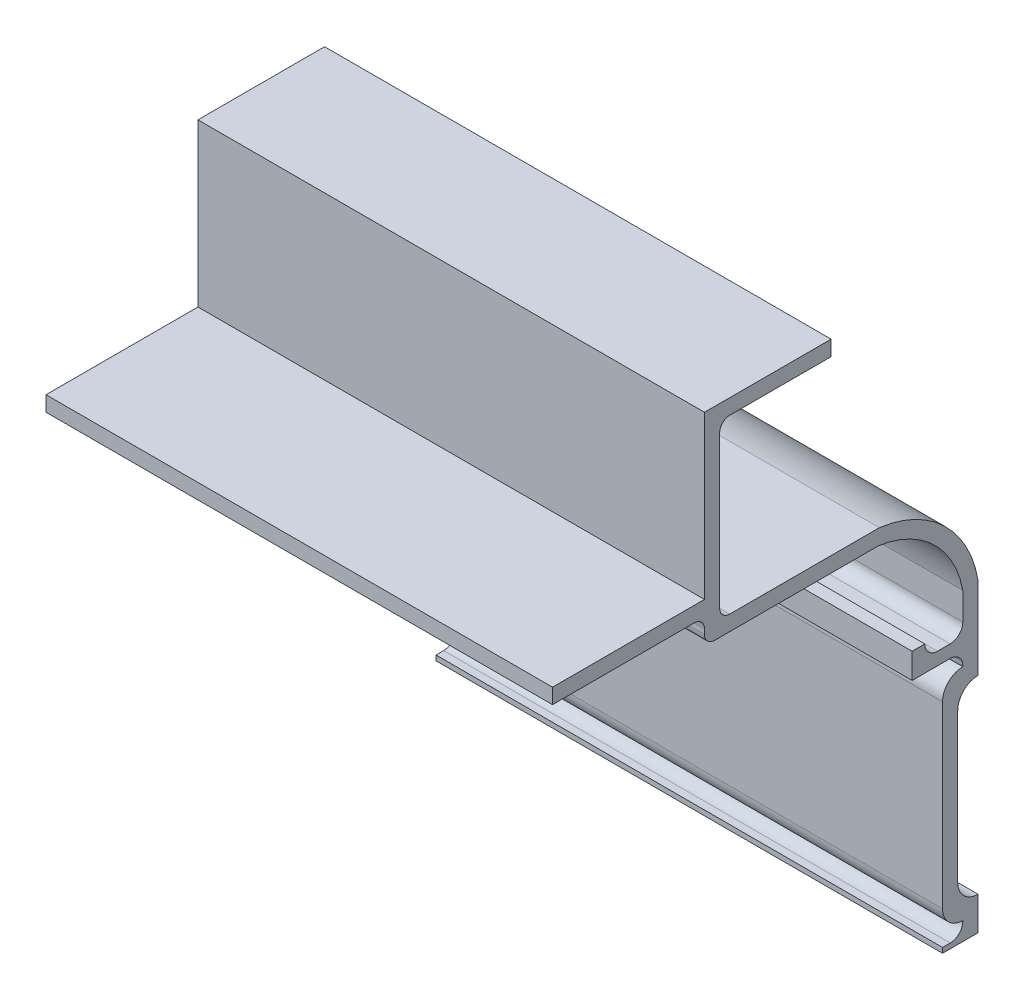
ISO-10303-21;
HEADER;
FILE_DESCRIPTION(('STEP AP214'),'2;1');
FILE_NAME('part.step','',(''),(''),'','','');
FILE_SCHEMA(('AUTOMOTIVE_DESIGN { 1 0 10303 214 1 1 1 1 }'));
ENDSEC;
DATA;
#1=APPLICATION_CONTEXT('core data for automotive mechanical design processes');
#2=APPLICATION_PROTOCOL_DEFINITION('international standard','automotive_design',2000,#1);
#3=PRODUCT_CONTEXT('',#1,'mechanical');
#4=PRODUCT('Part','Part','',(#3));
#5=PRODUCT_RELATED_PRODUCT_CATEGORY('part','',(#4));
#6=PRODUCT_DEFINITION_FORMATION('','',#4);
#7=PRODUCT_DEFINITION_CONTEXT('part definition',#1,'design');
#8=PRODUCT_DEFINITION('design','',#6,#7);
#9=PRODUCT_DEFINITION_SHAPE('','',#8);
#10=(LENGTH_UNIT() NAMED_UNIT(*) SI_UNIT(.MILLI.,.METRE.));
#11=(NAMED_UNIT(*) PLANE_ANGLE_UNIT() SI_UNIT($,.RADIAN.));
#12=(NAMED_UNIT(*) SI_UNIT($,.STERADIAN.) SOLID_ANGLE_UNIT());
#13=UNCERTAINTY_MEASURE_WITH_UNIT(LENGTH_MEASURE(1.E-05),#10,'distance_accuracy_value','');
#14=(GEOMETRIC_REPRESENTATION_CONTEXT(3) GLOBAL_UNCERTAINTY_ASSIGNED_CONTEXT((#13)) GLOBAL_UNIT_ASSIGNED_CONTEXT((#10,
#11,#12)) REPRESENTATION_CONTEXT('',''));
#15=CARTESIAN_POINT('',(0.,0.,0.));
#16=DIRECTION('',(0.,0.,1.));
#17=DIRECTION('',(1.,0.,0.));
#18=AXIS2_PLACEMENT_3D('',#15,#16,#17);
#19=CARTESIAN_POINT('',(50.,159.302992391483,-181.544676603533));
#20=DIRECTION('',(-1.,0.,0.));
#21=DIRECTION('',(0.,0.,1.));
#22=AXIS2_PLACEMENT_3D('',#19,#20,#21);
#23=CYLINDRICAL_SURFACE('',#22,22.6375207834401);
#24=CARTESIAN_POINT('',(-50.,159.302992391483,-181.544676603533));
#25=DIRECTION('',(1.,0.,0.));
#26=DIRECTION('',(0.,0.,-1.));
#27=AXIS2_PLACEMENT_3D('',#24,#25,#26);
#28=CIRCLE('',#27,22.6375207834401);
#29=CARTESIAN_POINT('',(-50.,163.045870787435,-203.870630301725));
#30=VERTEX_POINT('',#29);
#31=CARTESIAN_POINT('',(-50.,181.760397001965,-184.394645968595));
#32=VERTEX_POINT('',#31);
#33=EDGE_CURVE('E309',#30,#32,#28,.T.);
#34=ORIENTED_EDGE('',*,*,#33,.T.);
#35=DIRECTION('',(-1.,0.,0.));
#36=VECTOR('',#35,1.);
#37=CARTESIAN_POINT('',(50.,181.760397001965,-184.394645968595));
#38=LINE('',#37,#36);
#39=CARTESIAN_POINT('',(50.,181.760397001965,-184.394645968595));
#40=VERTEX_POINT('',#39);
#41=EDGE_CURVE('E11',#40,#32,#38,.T.);
#42=ORIENTED_EDGE('',*,*,#41,.F.);
#43=CARTESIAN_POINT('',(50.,159.302992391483,-181.544676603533));
#44=DIRECTION('',(1.,0.,0.));
#45=DIRECTION('',(0.,0.,-1.));
#46=AXIS2_PLACEMENT_3D('',#43,#44,#45);
#47=CIRCLE('',#46,22.6375207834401);
#48=CARTESIAN_POINT('',(50.,163.045870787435,-203.870630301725));
#49=VERTEX_POINT('',#48);
#50=EDGE_CURVE('E385',#49,#40,#47,.T.);
#51=ORIENTED_EDGE('',*,*,#50,.F.);
#52=DIRECTION('',(-1.,0.,0.));
#53=VECTOR('',#52,1.);
#54=CARTESIAN_POINT('',(50.,163.045870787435,-203.870630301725));
#55=LINE('',#54,#53);
#56=EDGE_CURVE('E305',#49,#30,#55,.T.);
#57=ORIENTED_EDGE('',*,*,#56,.T.);
#58=EDGE_LOOP('',(#34,#42,#51,#57));
#59=FACE_BOUND('',#58,.T.);
#60=ADVANCED_FACE('F32',(#59),#23,.T.);
#61=CARTESIAN_POINT('',(50.,181.760397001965,-154.870630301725));
#62=DIRECTION('',(0.,-1.,0.));
#63=DIRECTION('',(0.,0.,-1.));
#64=AXIS2_PLACEMENT_3D('',#61,#62,#63);
#65=PLANE('',#64);
#66=DIRECTION('',(0.,0.,1.));
#67=VECTOR('',#66,1.);
#68=CARTESIAN_POINT('',(-50.,181.760397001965,-154.870630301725));
#69=LINE('',#68,#67);
#70=CARTESIAN_POINT('',(-50.,181.760397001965,-154.870630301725));
#71=VERTEX_POINT('',#70);
#72=EDGE_CURVE('E312',#32,#71,#69,.T.);
#73=ORIENTED_EDGE('',*,*,#72,.T.);
#74=DIRECTION('',(-1.,0.,0.));
#75=VECTOR('',#74,1.);
#76=CARTESIAN_POINT('',(50.,181.760397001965,-154.870630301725));
#77=LINE('',#76,#75);
#78=CARTESIAN_POINT('',(50.,181.760397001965,-154.870630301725));
#79=VERTEX_POINT('',#78);
#80=EDGE_CURVE('E40',#79,#71,#77,.T.);
#81=ORIENTED_EDGE('',*,*,#80,.F.);
#82=DIRECTION('',(0.,0.,1.));
#83=VECTOR('',#82,1.);
#84=CARTESIAN_POINT('',(50.,181.760397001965,-154.870630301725));
#85=LINE('',#84,#83);
#86=EDGE_CURVE('E179',#40,#79,#85,.T.);
#87=ORIENTED_EDGE('',*,*,#86,.F.);
#88=ORIENTED_EDGE('',*,*,#41,.T.);
#89=EDGE_LOOP('',(#73,#81,#87,#88));
#90=FACE_BOUND('',#89,.T.);
#91=ADVANCED_FACE('F583',(#90),#65,.F.);
#92=CARTESIAN_POINT('',(50.,183.760397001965,-154.870630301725));
#93=DIRECTION('',(-1.,0.,0.));
#94=DIRECTION('',(0.,0.,1.));
#95=AXIS2_PLACEMENT_3D('',#92,#93,#94);
#96=CYLINDRICAL_SURFACE('',#95,2.);
#97=CARTESIAN_POINT('',(-50.,183.760397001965,-154.870630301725));
#98=DIRECTION('',(-1.,0.,0.));
#99=DIRECTION('',(0.,0.,-1.));
#100=AXIS2_PLACEMENT_3D('',#97,#98,#99);
#101=CIRCLE('',#100,2.);
#102=CARTESIAN_POINT('',(-50.,183.760397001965,-152.870630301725));
#103=VERTEX_POINT('',#102);
#104=EDGE_CURVE('E314',#71,#103,#101,.T.);
#105=ORIENTED_EDGE('',*,*,#104,.T.);
#106=DIRECTION('',(-1.,0.,0.));
#107=VECTOR('',#106,1.);
#108=CARTESIAN_POINT('',(50.,183.760397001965,-152.870630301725));
#109=LINE('',#108,#107);
#110=CARTESIAN_POINT('',(50.,183.760397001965,-152.870630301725));
#111=VERTEX_POINT('',#110);
#112=EDGE_CURVE('E482',#111,#103,#109,.T.);
#113=ORIENTED_EDGE('',*,*,#112,.F.);
#114=CARTESIAN_POINT('',(50.,183.760397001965,-154.870630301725));
#115=DIRECTION('',(-1.,0.,0.));
#116=DIRECTION('',(0.,0.,-1.));
#117=AXIS2_PLACEMENT_3D('',#114,#115,#116);
#118=CIRCLE('',#117,2.);
#119=EDGE_CURVE('E490',#79,#111,#118,.T.);
#120=ORIENTED_EDGE('',*,*,#119,.F.);
#121=ORIENTED_EDGE('',*,*,#80,.T.);
#122=EDGE_LOOP('',(#105,#113,#120,#121));
#123=FACE_BOUND('',#122,.T.);
#124=ADVANCED_FACE('F488',(#123),#96,.F.);
#125=CARTESIAN_POINT('',(50.,213.760397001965,-152.870630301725));
#126=DIRECTION('',(0.,0.,1.));
#127=DIRECTION('',(1.,0.,0.));
#128=AXIS2_PLACEMENT_3D('',#125,#126,#127);
#129=PLANE('',#128);
#130=DIRECTION('',(0.,1.,0.));
#131=VECTOR('',#130,1.);
#132=CARTESIAN_POINT('',(-50.,213.760397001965,-152.870630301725));
#133=LINE('',#132,#131);
#134=CARTESIAN_POINT('',(-50.,213.760397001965,-152.870630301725));
#135=VERTEX_POINT('',#134);
#136=EDGE_CURVE('E316',#103,#135,#133,.T.);
#137=ORIENTED_EDGE('',*,*,#136,.T.);
#138=DIRECTION('',(-1.,0.,0.));
#139=VECTOR('',#138,1.);
#140=CARTESIAN_POINT('',(50.,213.760397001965,-152.870630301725));
#141=LINE('',#140,#139);
#142=CARTESIAN_POINT('',(50.,213.760397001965,-152.870630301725));
#143=VERTEX_POINT('',#142);
#144=EDGE_CURVE('E479',#143,#135,#141,.T.);
#145=ORIENTED_EDGE('',*,*,#144,.F.);
#146=DIRECTION('',(0.,1.,0.));
#147=VECTOR('',#146,1.);
#148=CARTESIAN_POINT('',(50.,213.760397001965,-152.870630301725));
#149=LINE('',#148,#147);
#150=EDGE_CURVE('E506',#111,#143,#149,.T.);
#151=ORIENTED_EDGE('',*,*,#150,.F.);
#152=ORIENTED_EDGE('',*,*,#112,.T.);
#153=EDGE_LOOP('',(#137,#145,#151,#152));
#154=FACE_BOUND('',#153,.T.);
#155=ADVANCED_FACE('F497',(#154),#129,.F.);
#156=CARTESIAN_POINT('',(50.,213.760397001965,-154.870630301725));
#157=DIRECTION('',(-1.,0.,0.));
#158=DIRECTION('',(0.,0.,1.));
#159=AXIS2_PLACEMENT_3D('',#156,#157,#158);
#160=CYLINDRICAL_SURFACE('',#159,2.);
#161=CARTESIAN_POINT('',(-50.,213.760397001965,-154.870630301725));
#162=DIRECTION('',(-1.,0.,0.));
#163=DIRECTION('',(0.,0.,-1.));
#164=AXIS2_PLACEMENT_3D('',#161,#162,#163);
#165=CIRCLE('',#164,2.);
#166=CARTESIAN_POINT('',(-50.,215.760397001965,-154.870630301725));
#167=VERTEX_POINT('',#166);
#168=EDGE_CURVE('E318',#135,#167,#165,.T.);
#169=ORIENTED_EDGE('',*,*,#168,.T.);
#170=DIRECTION('',(-1.,0.,0.));
#171=VECTOR('',#170,1.);
#172=CARTESIAN_POINT('',(50.,215.760397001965,-154.870630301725));
#173=LINE('',#172,#171);
#174=CARTESIAN_POINT('',(50.,215.760397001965,-154.870630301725));
#175=VERTEX_POINT('',#174);
#176=EDGE_CURVE('E476',#175,#167,#173,.T.);
#177=ORIENTED_EDGE('',*,*,#176,.F.);
#178=CARTESIAN_POINT('',(50.,213.760397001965,-154.870630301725));
#179=DIRECTION('',(-1.,0.,0.));
#180=DIRECTION('',(0.,0.,-1.));
#181=AXIS2_PLACEMENT_3D('',#178,#179,#180);
#182=CIRCLE('',#181,2.);
#183=EDGE_CURVE('E503',#143,#175,#182,.T.);
#184=ORIENTED_EDGE('',*,*,#183,.F.);
#185=ORIENTED_EDGE('',*,*,#144,.T.);
#186=EDGE_LOOP('',(#169,#177,#184,#185));
#187=FACE_BOUND('',#186,.T.);
#188=ADVANCED_FACE('F501',(#187),#160,.F.);
#189=CARTESIAN_POINT('',(50.,215.760397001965,-174.870630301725));
#190=DIRECTION('',(0.,1.,0.));
#191=DIRECTION('',(0.,0.,1.));
#192=AXIS2_PLACEMENT_3D('',#189,#190,#191);
#193=PLANE('',#192);
#194=DIRECTION('',(0.,0.,-1.));
#195=VECTOR('',#194,1.);
#196=CARTESIAN_POINT('',(-50.,215.760397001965,-174.870630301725));
#197=LINE('',#196,#195);
#198=CARTESIAN_POINT('',(-50.,215.760397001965,-174.870630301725));
#199=VERTEX_POINT('',#198);
#200=EDGE_CURVE('E320',#167,#199,#197,.T.);
#201=ORIENTED_EDGE('',*,*,#200,.T.);
#202=DIRECTION('',(-1.,0.,0.));
#203=VECTOR('',#202,1.);
#204=CARTESIAN_POINT('',(50.,215.760397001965,-174.870630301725));
#205=LINE('',#204,#203);
#206=CARTESIAN_POINT('',(50.,215.760397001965,-174.870630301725));
#207=VERTEX_POINT('',#206);
#208=EDGE_CURVE('E473',#207,#199,#205,.T.);
#209=ORIENTED_EDGE('',*,*,#208,.F.);
#210=DIRECTION('',(0.,0.,-1.));
#211=VECTOR('',#210,1.);
#212=CARTESIAN_POINT('',(50.,215.760397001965,-174.870630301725));
#213=LINE('',#212,#211);
#214=EDGE_CURVE('E505',#175,#207,#213,.T.);
#215=ORIENTED_EDGE('',*,*,#214,.F.);
#216=ORIENTED_EDGE('',*,*,#176,.T.);
#217=EDGE_LOOP('',(#201,#209,#215,#216));
#218=FACE_BOUND('',#217,.T.);
#219=ADVANCED_FACE('F595',(#218),#193,.F.);
#220=CARTESIAN_POINT('',(50.,218.760397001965,-174.870630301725));
#221=DIRECTION('',(0.,0.,1.));
#222=DIRECTION('',(1.,0.,0.));
#223=AXIS2_PLACEMENT_3D('',#220,#221,#222);
#224=PLANE('',#223);
#225=DIRECTION('',(0.,1.,0.));
#226=VECTOR('',#225,1.);
#227=CARTESIAN_POINT('',(-50.,218.760397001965,-174.870630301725));
#228=LINE('',#227,#226);
#229=CARTESIAN_POINT('',(-50.,218.760397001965,-174.870630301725));
#230=VERTEX_POINT('',#229);
#231=EDGE_CURVE('E322',#199,#230,#228,.T.);
#232=ORIENTED_EDGE('',*,*,#231,.T.);
#233=DIRECTION('',(-1.,0.,0.));
#234=VECTOR('',#233,1.);
#235=CARTESIAN_POINT('',(50.,218.760397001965,-174.870630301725));
#236=LINE('',#235,#234);
#237=CARTESIAN_POINT('',(50.,218.760397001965,-174.870630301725));
#238=VERTEX_POINT('',#237);
#239=EDGE_CURVE('E470',#238,#230,#236,.T.);
#240=ORIENTED_EDGE('',*,*,#239,.F.);
#241=DIRECTION('',(0.,1.,0.));
#242=VECTOR('',#241,1.);
#243=CARTESIAN_POINT('',(50.,218.760397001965,-174.870630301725));
#244=LINE('',#243,#242);
#245=EDGE_CURVE('E508',#207,#238,#244,.T.);
#246=ORIENTED_EDGE('',*,*,#245,.F.);
#247=ORIENTED_EDGE('',*,*,#208,.T.);
#248=EDGE_LOOP('',(#232,#240,#246,#247));
#249=FACE_BOUND('',#248,.T.);
#250=ADVANCED_FACE('F598',(#249),#224,.F.);
#251=CARTESIAN_POINT('',(50.,218.760397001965,-174.870630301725));
#252=DIRECTION('',(0.,-1.,0.));
#253=DIRECTION('',(0.,0.,-1.));
#254=AXIS2_PLACEMENT_3D('',#251,#252,#253);
#255=PLANE('',#254);
#256=DIRECTION('',(0.,0.,1.));
#257=VECTOR('',#256,1.);
#258=CARTESIAN_POINT('',(-50.,218.760397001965,-174.870630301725));
#259=LINE('',#258,#257);
#260=CARTESIAN_POINT('',(-50.,218.760397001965,-149.870630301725));
#261=VERTEX_POINT('',#260);
#262=EDGE_CURVE('E324',#230,#261,#259,.T.);
#263=ORIENTED_EDGE('',*,*,#262,.T.);
#264=DIRECTION('',(-1.,0.,0.));
#265=VECTOR('',#264,1.);
#266=CARTESIAN_POINT('',(50.,218.760397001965,-149.870630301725));
#267=LINE('',#266,#265);
#268=CARTESIAN_POINT('',(50.,218.760397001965,-149.870630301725));
#269=VERTEX_POINT('',#268);
#270=EDGE_CURVE('E467',#269,#261,#267,.T.);
#271=ORIENTED_EDGE('',*,*,#270,.F.);
#272=DIRECTION('',(0.,0.,1.));
#273=VECTOR('',#272,1.);
#274=CARTESIAN_POINT('',(50.,218.760397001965,-174.870630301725));
#275=LINE('',#274,#273);
#276=EDGE_CURVE('E514',#238,#269,#275,.T.);
#277=ORIENTED_EDGE('',*,*,#276,.F.);
#278=ORIENTED_EDGE('',*,*,#239,.T.);
#279=EDGE_LOOP('',(#263,#271,#277,#278));
#280=FACE_BOUND('',#279,.T.);
#281=ADVANCED_FACE('F602',(#280),#255,.F.);
#282=CARTESIAN_POINT('',(50.,218.760397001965,-149.870630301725));
#283=DIRECTION('',(0.,0.,-1.));
#284=DIRECTION('',(-1.,0.,0.));
#285=AXIS2_PLACEMENT_3D('',#282,#283,#284);
#286=PLANE('',#285);
#287=DIRECTION('',(0.,-1.,0.));
#288=VECTOR('',#287,1.);
#289=CARTESIAN_POINT('',(-50.,218.760397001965,-149.870630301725));
#290=LINE('',#289,#288);
#291=CARTESIAN_POINT('',(-50.,186.760397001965,-149.870630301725));
#292=VERTEX_POINT('',#291);
#293=EDGE_CURVE('E326',#261,#292,#290,.T.);
#294=ORIENTED_EDGE('',*,*,#293,.T.);
#295=DIRECTION('',(-1.,0.,0.));
#296=VECTOR('',#295,1.);
#297=CARTESIAN_POINT('',(50.,186.760397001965,-149.870630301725));
#298=LINE('',#297,#296);
#299=CARTESIAN_POINT('',(50.,186.760397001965,-149.870630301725));
#300=VERTEX_POINT('',#299);
#301=EDGE_CURVE('E464',#300,#292,#298,.T.);
#302=ORIENTED_EDGE('',*,*,#301,.F.);
#303=DIRECTION('',(0.,-1.,0.));
#304=VECTOR('',#303,1.);
#305=CARTESIAN_POINT('',(50.,218.760397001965,-149.870630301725));
#306=LINE('',#305,#304);
#307=EDGE_CURVE('E516',#269,#300,#306,.T.);
#308=ORIENTED_EDGE('',*,*,#307,.F.);
#309=ORIENTED_EDGE('',*,*,#270,.T.);
#310=EDGE_LOOP('',(#294,#302,#308,#309));
#311=FACE_BOUND('',#310,.T.);
#312=ADVANCED_FACE('F606',(#311),#286,.F.);
#313=CARTESIAN_POINT('',(50.,186.760397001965,-149.870630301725));
#314=DIRECTION('',(0.,-1.,0.));
#315=DIRECTION('',(0.,0.,-1.));
#316=AXIS2_PLACEMENT_3D('',#313,#314,#315);
#317=PLANE('',#316);
#318=DIRECTION('',(0.,0.,1.));
#319=VECTOR('',#318,1.);
#320=CARTESIAN_POINT('',(-50.,186.760397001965,-149.870630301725));
#321=LINE('',#320,#319);
#322=CARTESIAN_POINT('',(-50.,186.760397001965,-119.870630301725));
#323=VERTEX_POINT('',#322);
#324=EDGE_CURVE('E328',#292,#323,#321,.T.);
#325=ORIENTED_EDGE('',*,*,#324,.T.);
#326=DIRECTION('',(-1.,0.,0.));
#327=VECTOR('',#326,1.);
#328=CARTESIAN_POINT('',(50.,186.760397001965,-119.870630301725));
#329=LINE('',#328,#327);
#330=CARTESIAN_POINT('',(50.,186.760397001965,-119.870630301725));
#331=VERTEX_POINT('',#330);
#332=EDGE_CURVE('E461',#331,#323,#329,.T.);
#333=ORIENTED_EDGE('',*,*,#332,.F.);
#334=DIRECTION('',(0.,0.,1.));
#335=VECTOR('',#334,1.);
#336=CARTESIAN_POINT('',(50.,186.760397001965,-149.870630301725));
#337=LINE('',#336,#335);
#338=EDGE_CURVE('E518',#300,#331,#337,.T.);
#339=ORIENTED_EDGE('',*,*,#338,.F.);
#340=ORIENTED_EDGE('',*,*,#301,.T.);
#341=EDGE_LOOP('',(#325,#333,#339,#340));
#342=FACE_BOUND('',#341,.T.);
#343=ADVANCED_FACE('F610',(#342),#317,.F.);
#344=CARTESIAN_POINT('',(50.,186.760397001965,-119.870630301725));
#345=DIRECTION('',(0.,3.00685402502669E-13,-1.));
#346=DIRECTION('',(0.,1.,3.00685402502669E-13));
#347=AXIS2_PLACEMENT_3D('',#344,#345,#346);
#348=PLANE('',#347);
#349=DIRECTION('',(0.,-1.,-3.00685402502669E-13));
#350=VECTOR('',#349,1.);
#351=CARTESIAN_POINT('',(-50.,186.760397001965,-119.870630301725));
#352=LINE('',#351,#350);
#353=CARTESIAN_POINT('',(-50.,183.760397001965,-119.870630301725));
#354=VERTEX_POINT('',#353);
#355=EDGE_CURVE('E330',#323,#354,#352,.T.);
#356=ORIENTED_EDGE('',*,*,#355,.T.);
#357=DIRECTION('',(-1.,0.,0.));
#358=VECTOR('',#357,1.);
#359=CARTESIAN_POINT('',(50.,183.760397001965,-119.870630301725));
#360=LINE('',#359,#358);
#361=CARTESIAN_POINT('',(50.,183.760397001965,-119.870630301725));
#362=VERTEX_POINT('',#361);
#363=EDGE_CURVE('E458',#362,#354,#360,.T.);
#364=ORIENTED_EDGE('',*,*,#363,.F.);
#365=DIRECTION('',(0.,-1.,-3.00685402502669E-13));
#366=VECTOR('',#365,1.);
#367=CARTESIAN_POINT('',(50.,186.760397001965,-119.870630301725));
#368=LINE('',#367,#366);
#369=EDGE_CURVE('E520',#331,#362,#368,.T.);
#370=ORIENTED_EDGE('',*,*,#369,.F.);
#371=ORIENTED_EDGE('',*,*,#332,.T.);
#372=EDGE_LOOP('',(#356,#364,#370,#371));
#373=FACE_BOUND('',#372,.T.);
#374=ADVANCED_FACE('F614',(#373),#348,.F.);
#375=CARTESIAN_POINT('',(50.,183.760397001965,-147.870630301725));
#376=DIRECTION('',(0.,1.,0.));
#377=DIRECTION('',(0.,0.,1.));
#378=AXIS2_PLACEMENT_3D('',#375,#376,#377);
#379=PLANE('',#378);
#380=DIRECTION('',(0.,0.,-1.));
#381=VECTOR('',#380,1.);
#382=CARTESIAN_POINT('',(-50.,183.760397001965,-147.870630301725));
#383=LINE('',#382,#381);
#384=CARTESIAN_POINT('',(-50.,183.760397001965,-147.870630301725));
#385=VERTEX_POINT('',#384);
#386=EDGE_CURVE('E332',#354,#385,#383,.T.);
#387=ORIENTED_EDGE('',*,*,#386,.T.);
#388=DIRECTION('',(-1.,0.,0.));
#389=VECTOR('',#388,1.);
#390=CARTESIAN_POINT('',(50.,183.760397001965,-147.870630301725));
#391=LINE('',#390,#389);
#392=CARTESIAN_POINT('',(50.,183.760397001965,-147.870630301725));
#393=VERTEX_POINT('',#392);
#394=EDGE_CURVE('E455',#393,#385,#391,.T.);
#395=ORIENTED_EDGE('',*,*,#394,.F.);
#396=DIRECTION('',(0.,0.,-1.));
#397=VECTOR('',#396,1.);
#398=CARTESIAN_POINT('',(50.,183.760397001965,-147.870630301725));
#399=LINE('',#398,#397);
#400=EDGE_CURVE('E522',#362,#393,#399,.T.);
#401=ORIENTED_EDGE('',*,*,#400,.F.);
#402=ORIENTED_EDGE('',*,*,#363,.T.);
#403=EDGE_LOOP('',(#387,#395,#401,#402));
#404=FACE_BOUND('',#403,.T.);
#405=ADVANCED_FACE('F618',(#404),#379,.F.);
#406=CARTESIAN_POINT('',(50.,181.760397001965,-147.870630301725));
#407=DIRECTION('',(-1.,0.,0.));
#408=DIRECTION('',(0.,0.,1.));
#409=AXIS2_PLACEMENT_3D('',#406,#407,#408);
#410=CYLINDRICAL_SURFACE('',#409,2.);
#411=CARTESIAN_POINT('',(-50.,181.760397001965,-147.870630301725));
#412=DIRECTION('',(-1.,0.,0.));
#413=DIRECTION('',(0.,0.,-1.));
#414=AXIS2_PLACEMENT_3D('',#411,#412,#413);
#415=CIRCLE('',#414,2.);
#416=CARTESIAN_POINT('',(-50.,181.760397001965,-149.870630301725));
#417=VERTEX_POINT('',#416);
#418=EDGE_CURVE('E334',#385,#417,#415,.T.);
#419=ORIENTED_EDGE('',*,*,#418,.T.);
#420=DIRECTION('',(-1.,0.,0.));
#421=VECTOR('',#420,1.);
#422=CARTESIAN_POINT('',(50.,181.760397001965,-149.870630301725));
#423=LINE('',#422,#421);
#424=CARTESIAN_POINT('',(50.,181.760397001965,-149.870630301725));
#425=VERTEX_POINT('',#424);
#426=EDGE_CURVE('E452',#425,#417,#423,.T.);
#427=ORIENTED_EDGE('',*,*,#426,.F.);
#428=CARTESIAN_POINT('',(50.,181.760397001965,-147.870630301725));
#429=DIRECTION('',(-1.,0.,0.));
#430=DIRECTION('',(0.,0.,-1.));
#431=AXIS2_PLACEMENT_3D('',#428,#429,#430);
#432=CIRCLE('',#431,2.);
#433=EDGE_CURVE('E524',#393,#425,#432,.T.);
#434=ORIENTED_EDGE('',*,*,#433,.F.);
#435=ORIENTED_EDGE('',*,*,#394,.T.);
#436=EDGE_LOOP('',(#419,#427,#434,#435));
#437=FACE_BOUND('',#436,.T.);
#438=ADVANCED_FACE('F622',(#437),#410,.F.);
#439=CARTESIAN_POINT('',(50.,181.760397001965,-149.870630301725));
#440=DIRECTION('',(0.,0.,-1.));
#441=DIRECTION('',(-1.,0.,0.));
#442=AXIS2_PLACEMENT_3D('',#439,#440,#441);
#443=PLANE('',#442);
#444=DIRECTION('',(0.,-1.,0.));
#445=VECTOR('',#444,1.);
#446=CARTESIAN_POINT('',(-50.,181.760397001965,-149.870630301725));
#447=LINE('',#446,#445);
#448=CARTESIAN_POINT('',(-50.,180.760397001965,-149.870630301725));
#449=VERTEX_POINT('',#448);
#450=EDGE_CURVE('E336',#417,#449,#447,.T.);
#451=ORIENTED_EDGE('',*,*,#450,.T.);
#452=DIRECTION('',(-1.,0.,0.));
#453=VECTOR('',#452,1.);
#454=CARTESIAN_POINT('',(50.,180.760397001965,-149.870630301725));
#455=LINE('',#454,#453);
#456=CARTESIAN_POINT('',(50.,180.760397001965,-149.870630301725));
#457=VERTEX_POINT('',#456);
#458=EDGE_CURVE('E449',#457,#449,#455,.T.);
#459=ORIENTED_EDGE('',*,*,#458,.F.);
#460=DIRECTION('',(0.,-1.,0.));
#461=VECTOR('',#460,1.);
#462=CARTESIAN_POINT('',(50.,181.760397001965,-149.870630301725));
#463=LINE('',#462,#461);
#464=EDGE_CURVE('E526',#425,#457,#463,.T.);
#465=ORIENTED_EDGE('',*,*,#464,.F.);
#466=ORIENTED_EDGE('',*,*,#426,.T.);
#467=EDGE_LOOP('',(#451,#459,#465,#466));
#468=FACE_BOUND('',#467,.T.);
#469=ADVANCED_FACE('F626',(#468),#443,.F.);
#470=CARTESIAN_POINT('',(50.,180.760397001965,-151.870630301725));
#471=DIRECTION('',(-1.,0.,0.));
#472=DIRECTION('',(0.,0.,1.));
#473=AXIS2_PLACEMENT_3D('',#470,#471,#472);
#474=CYLINDRICAL_SURFACE('',#473,2.);
#475=CARTESIAN_POINT('',(-50.,180.760397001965,-151.870630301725));
#476=DIRECTION('',(1.,0.,0.));
#477=DIRECTION('',(0.,0.,-1.));
#478=AXIS2_PLACEMENT_3D('',#475,#476,#477);
#479=CIRCLE('',#478,2.);
#480=CARTESIAN_POINT('',(-50.,178.760397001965,-151.870630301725));
#481=VERTEX_POINT('',#480);
#482=EDGE_CURVE('E338',#449,#481,#479,.T.);
#483=ORIENTED_EDGE('',*,*,#482,.T.);
#484=DIRECTION('',(-1.,0.,0.));
#485=VECTOR('',#484,1.);
#486=CARTESIAN_POINT('',(50.,178.760397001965,-151.870630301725));
#487=LINE('',#486,#485);
#488=CARTESIAN_POINT('',(50.,178.760397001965,-151.870630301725));
#489=VERTEX_POINT('',#488);
#490=EDGE_CURVE('E446',#489,#481,#487,.T.);
#491=ORIENTED_EDGE('',*,*,#490,.F.);
#492=CARTESIAN_POINT('',(50.,180.760397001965,-151.870630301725));
#493=DIRECTION('',(1.,0.,0.));
#494=DIRECTION('',(0.,0.,-1.));
#495=AXIS2_PLACEMENT_3D('',#492,#493,#494);
#496=CIRCLE('',#495,2.);
#497=EDGE_CURVE('E528',#457,#489,#496,.T.);
#498=ORIENTED_EDGE('',*,*,#497,.F.);
#499=ORIENTED_EDGE('',*,*,#458,.T.);
#500=EDGE_LOOP('',(#483,#491,#498,#499));
#501=FACE_BOUND('',#500,.T.);
#502=ADVANCED_FACE('F630',(#501),#474,.T.);
#503=CARTESIAN_POINT('',(50.,178.760397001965,-151.870630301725));
#504=DIRECTION('',(0.,1.,0.));
#505=DIRECTION('',(0.,0.,1.));
#506=AXIS2_PLACEMENT_3D('',#503,#504,#505);
#507=PLANE('',#506);
#508=DIRECTION('',(0.,0.,-1.));
#509=VECTOR('',#508,1.);
#510=CARTESIAN_POINT('',(-50.,178.760397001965,-151.870630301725));
#511=LINE('',#510,#509);
#512=CARTESIAN_POINT('',(-50.,178.760397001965,-184.198283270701));
#513=VERTEX_POINT('',#512);
#514=EDGE_CURVE('E340',#481,#513,#511,.T.);
#515=ORIENTED_EDGE('',*,*,#514,.T.);
#516=DIRECTION('',(-1.,0.,0.));
#517=VECTOR('',#516,1.);
#518=CARTESIAN_POINT('',(50.,178.760397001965,-184.198283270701));
#519=LINE('',#518,#517);
#520=CARTESIAN_POINT('',(50.,178.760397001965,-184.198283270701));
#521=VERTEX_POINT('',#520);
#522=EDGE_CURVE('E443',#521,#513,#519,.T.);
#523=ORIENTED_EDGE('',*,*,#522,.F.);
#524=DIRECTION('',(0.,0.,-1.));
#525=VECTOR('',#524,1.);
#526=CARTESIAN_POINT('',(50.,178.760397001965,-151.870630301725));
#527=LINE('',#526,#525);
#528=EDGE_CURVE('E530',#489,#521,#527,.T.);
#529=ORIENTED_EDGE('',*,*,#528,.F.);
#530=ORIENTED_EDGE('',*,*,#490,.T.);
#531=EDGE_LOOP('',(#515,#523,#529,#530));
#532=FACE_BOUND('',#531,.T.);
#533=ADVANCED_FACE('F634',(#532),#507,.F.);
#534=CARTESIAN_POINT('',(50.,159.302992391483,-181.544676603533));
#535=DIRECTION('',(-1.,0.,0.));
#536=DIRECTION('',(0.,0.,1.));
#537=AXIS2_PLACEMENT_3D('',#534,#535,#536);
#538=CYLINDRICAL_SURFACE('',#537,19.6375207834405);
#539=CARTESIAN_POINT('',(-50.,159.302992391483,-181.544676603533));
#540=DIRECTION('',(-1.,0.,0.));
#541=DIRECTION('',(0.,0.,-1.));
#542=AXIS2_PLACEMENT_3D('',#539,#540,#541);
#543=CIRCLE('',#542,19.6375207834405);
#544=CARTESIAN_POINT('',(-50.,162.787204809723,-200.870630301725));
#545=VERTEX_POINT('',#544);
#546=EDGE_CURVE('E342',#513,#545,#543,.T.);
#547=ORIENTED_EDGE('',*,*,#546,.T.);
#548=DIRECTION('',(-1.,0.,0.));
#549=VECTOR('',#548,1.);
#550=CARTESIAN_POINT('',(50.,162.787204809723,-200.870630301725));
#551=LINE('',#550,#549);
#552=CARTESIAN_POINT('',(50.,162.787204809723,-200.870630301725));
#553=VERTEX_POINT('',#552);
#554=EDGE_CURVE('E440',#553,#545,#551,.T.);
#555=ORIENTED_EDGE('',*,*,#554,.F.);
#556=CARTESIAN_POINT('',(50.,159.302992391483,-181.544676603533));
#557=DIRECTION('',(-1.,0.,0.));
#558=DIRECTION('',(0.,0.,-1.));
#559=AXIS2_PLACEMENT_3D('',#556,#557,#558);
#560=CIRCLE('',#559,19.6375207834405);
#561=EDGE_CURVE('E532',#521,#553,#560,.T.);
#562=ORIENTED_EDGE('',*,*,#561,.F.);
#563=ORIENTED_EDGE('',*,*,#522,.T.);
#564=EDGE_LOOP('',(#547,#555,#562,#563));
#565=FACE_BOUND('',#564,.T.);
#566=ADVANCED_FACE('F638',(#565),#538,.F.);
#567=CARTESIAN_POINT('',(50.,162.787204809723,-200.870630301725));
#568=DIRECTION('',(0.,0.,-1.));
#569=DIRECTION('',(-1.,0.,0.));
#570=AXIS2_PLACEMENT_3D('',#567,#568,#569);
#571=PLANE('',#570);
#572=DIRECTION('',(0.,-1.,0.));
#573=VECTOR('',#572,1.);
#574=CARTESIAN_POINT('',(-50.,162.787204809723,-200.870630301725));
#575=LINE('',#574,#573);
#576=CARTESIAN_POINT('',(-50.,157.405291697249,-200.870630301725));
#577=VERTEX_POINT('',#576);
#578=EDGE_CURVE('E344',#545,#577,#575,.T.);
#579=ORIENTED_EDGE('',*,*,#578,.T.);
#580=DIRECTION('',(-1.,0.,0.));
#581=VECTOR('',#580,1.);
#582=CARTESIAN_POINT('',(50.,157.405291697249,-200.870630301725));
#583=LINE('',#582,#581);
#584=CARTESIAN_POINT('',(50.,157.405291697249,-200.870630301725));
#585=VERTEX_POINT('',#584);
#586=EDGE_CURVE('E437',#585,#577,#583,.T.);
#587=ORIENTED_EDGE('',*,*,#586,.F.);
#588=DIRECTION('',(0.,-1.,0.));
#589=VECTOR('',#588,1.);
#590=CARTESIAN_POINT('',(50.,162.787204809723,-200.870630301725));
#591=LINE('',#590,#589);
#592=EDGE_CURVE('E534',#553,#585,#591,.T.);
#593=ORIENTED_EDGE('',*,*,#592,.F.);
#594=ORIENTED_EDGE('',*,*,#554,.T.);
#595=EDGE_LOOP('',(#579,#587,#593,#594));
#596=FACE_BOUND('',#595,.T.);
#597=ADVANCED_FACE('F642',(#596),#571,.F.);
#598=CARTESIAN_POINT('',(50.,157.405291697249,-198.370630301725));
#599=DIRECTION('',(-1.,0.,0.));
#600=DIRECTION('',(0.,0.,1.));
#601=AXIS2_PLACEMENT_3D('',#598,#599,#600);
#602=CYLINDRICAL_SURFACE('',#601,2.5);
#603=CARTESIAN_POINT('',(-50.,157.405291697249,-198.370630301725));
#604=DIRECTION('',(-1.,0.,0.));
#605=DIRECTION('',(0.,0.,-1.));
#606=AXIS2_PLACEMENT_3D('',#603,#604,#605);
#607=CIRCLE('',#606,2.5);
#608=CARTESIAN_POINT('',(-50.,154.905291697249,-198.370630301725));
#609=VERTEX_POINT('',#608);
#610=EDGE_CURVE('E346',#577,#609,#607,.T.);
#611=ORIENTED_EDGE('',*,*,#610,.T.);
#612=DIRECTION('',(-1.,0.,0.));
#613=VECTOR('',#612,1.);
#614=CARTESIAN_POINT('',(50.,154.905291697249,-198.370630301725));
#615=LINE('',#614,#613);
#616=CARTESIAN_POINT('',(50.,154.905291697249,-198.370630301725));
#617=VERTEX_POINT('',#616);
#618=EDGE_CURVE('E434',#617,#609,#615,.T.);
#619=ORIENTED_EDGE('',*,*,#618,.F.);
#620=CARTESIAN_POINT('',(50.,157.405291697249,-198.370630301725));
#621=DIRECTION('',(-1.,0.,0.));
#622=DIRECTION('',(0.,0.,-1.));
#623=AXIS2_PLACEMENT_3D('',#620,#621,#622);
#624=CIRCLE('',#623,2.5);
#625=EDGE_CURVE('E536',#585,#617,#624,.T.);
#626=ORIENTED_EDGE('',*,*,#625,.F.);
#627=ORIENTED_EDGE('',*,*,#586,.T.);
#628=EDGE_LOOP('',(#611,#619,#626,#627));
#629=FACE_BOUND('',#628,.T.);
#630=ADVANCED_FACE('F646',(#629),#602,.F.);
#631=CARTESIAN_POINT('',(50.,154.905291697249,-195.870630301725));
#632=DIRECTION('',(0.,-1.,0.));
#633=DIRECTION('',(0.,0.,-1.));
#634=AXIS2_PLACEMENT_3D('',#631,#632,#633);
#635=PLANE('',#634);
#636=DIRECTION('',(0.,0.,1.));
#637=VECTOR('',#636,1.);
#638=CARTESIAN_POINT('',(-50.,154.905291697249,-195.870630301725));
#639=LINE('',#638,#637);
#640=CARTESIAN_POINT('',(-50.,154.905291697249,-195.870630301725));
#641=VERTEX_POINT('',#640);
#642=EDGE_CURVE('E348',#609,#641,#639,.T.);
#643=ORIENTED_EDGE('',*,*,#642,.T.);
#644=DIRECTION('',(-1.,0.,0.));
#645=VECTOR('',#644,1.);
#646=CARTESIAN_POINT('',(50.,154.905291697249,-195.870630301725));
#647=LINE('',#646,#645);
#648=CARTESIAN_POINT('',(50.,154.905291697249,-195.870630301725));
#649=VERTEX_POINT('',#648);
#650=EDGE_CURVE('E431',#649,#641,#647,.T.);
#651=ORIENTED_EDGE('',*,*,#650,.F.);
#652=DIRECTION('',(0.,0.,1.));
#653=VECTOR('',#652,1.);
#654=CARTESIAN_POINT('',(50.,154.905291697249,-195.870630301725));
#655=LINE('',#654,#653);
#656=EDGE_CURVE('E538',#617,#649,#655,.T.);
#657=ORIENTED_EDGE('',*,*,#656,.F.);
#658=ORIENTED_EDGE('',*,*,#618,.T.);
#659=EDGE_LOOP('',(#643,#651,#657,#658));
#660=FACE_BOUND('',#659,.T.);
#661=ADVANCED_FACE('F650',(#660),#635,.F.);
#662=CARTESIAN_POINT('',(50.,157.405291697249,-195.870630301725));
#663=DIRECTION('',(-1.,0.,0.));
#664=DIRECTION('',(0.,0.,1.));
#665=AXIS2_PLACEMENT_3D('',#662,#663,#664);
#666=CYLINDRICAL_SURFACE('',#665,2.5);
#667=CARTESIAN_POINT('',(-50.,157.405291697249,-195.870630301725));
#668=DIRECTION('',(-1.,0.,0.));
#669=DIRECTION('',(0.,0.,-1.));
#670=AXIS2_PLACEMENT_3D('',#667,#668,#669);
#671=CIRCLE('',#670,2.5);
#672=CARTESIAN_POINT('',(-50.,157.405291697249,-193.370630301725));
#673=VERTEX_POINT('',#672);
#674=EDGE_CURVE('E350',#641,#673,#671,.T.);
#675=ORIENTED_EDGE('',*,*,#674,.T.);
#676=DIRECTION('',(-1.,0.,0.));
#677=VECTOR('',#676,1.);
#678=CARTESIAN_POINT('',(50.,157.405291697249,-193.370630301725));
#679=LINE('',#678,#677);
#680=CARTESIAN_POINT('',(50.,157.405291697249,-193.370630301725));
#681=VERTEX_POINT('',#680);
#682=EDGE_CURVE('E428',#681,#673,#679,.T.);
#683=ORIENTED_EDGE('',*,*,#682,.F.);
#684=CARTESIAN_POINT('',(50.,157.405291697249,-195.870630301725));
#685=DIRECTION('',(-1.,0.,0.));
#686=DIRECTION('',(0.,0.,-1.));
#687=AXIS2_PLACEMENT_3D('',#684,#685,#686);
#688=CIRCLE('',#687,2.5);
#689=EDGE_CURVE('E540',#649,#681,#688,.T.);
#690=ORIENTED_EDGE('',*,*,#689,.F.);
#691=ORIENTED_EDGE('',*,*,#650,.T.);
#692=EDGE_LOOP('',(#675,#683,#690,#691));
#693=FACE_BOUND('',#692,.T.);
#694=ADVANCED_FACE('F654',(#693),#666,.F.);
#695=CARTESIAN_POINT('',(50.,157.405291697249,-190.870630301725));
#696=DIRECTION('',(0.,-1.,-1.11022302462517E-13));
#697=DIRECTION('',(0.,1.11022302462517E-13,-1.));
#698=AXIS2_PLACEMENT_3D('',#695,#696,#697);
#699=PLANE('',#698);
#700=DIRECTION('',(0.,-1.11022302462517E-13,1.));
#701=VECTOR('',#700,1.);
#702=CARTESIAN_POINT('',(-50.,157.405291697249,-190.870630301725));
#703=LINE('',#702,#701);
#704=CARTESIAN_POINT('',(-50.,157.405291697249,-190.870630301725));
#705=VERTEX_POINT('',#704);
#706=EDGE_CURVE('E352',#673,#705,#703,.T.);
#707=ORIENTED_EDGE('',*,*,#706,.T.);
#708=DIRECTION('',(-1.,0.,0.));
#709=VECTOR('',#708,1.);
#710=CARTESIAN_POINT('',(50.,157.405291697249,-190.870630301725));
#711=LINE('',#710,#709);
#712=CARTESIAN_POINT('',(50.,157.405291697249,-190.870630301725));
#713=VERTEX_POINT('',#712);
#714=EDGE_CURVE('E425',#713,#705,#711,.T.);
#715=ORIENTED_EDGE('',*,*,#714,.F.);
#716=DIRECTION('',(0.,-1.11022302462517E-13,1.));
#717=VECTOR('',#716,1.);
#718=CARTESIAN_POINT('',(50.,157.405291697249,-190.870630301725));
#719=LINE('',#718,#717);
#720=EDGE_CURVE('E542',#681,#713,#719,.T.);
#721=ORIENTED_EDGE('',*,*,#720,.F.);
#722=ORIENTED_EDGE('',*,*,#682,.T.);
#723=EDGE_LOOP('',(#707,#715,#721,#722));
#724=FACE_BOUND('',#723,.T.);
#725=ADVANCED_FACE('F658',(#724),#699,.F.);
#726=CARTESIAN_POINT('',(50.,157.405291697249,-190.870630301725));
#727=DIRECTION('',(0.,0.,-1.));
#728=DIRECTION('',(-1.,0.,0.));
#729=AXIS2_PLACEMENT_3D('',#726,#727,#728);
#730=PLANE('',#729);
#731=DIRECTION('',(0.,-1.,0.));
#732=VECTOR('',#731,1.);
#733=CARTESIAN_POINT('',(-50.,157.405291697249,-190.870630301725));
#734=LINE('',#733,#732);
#735=CARTESIAN_POINT('',(-50.,152.405291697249,-190.870630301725));
#736=VERTEX_POINT('',#735);
#737=EDGE_CURVE('E354',#705,#736,#734,.T.);
#738=ORIENTED_EDGE('',*,*,#737,.T.);
#739=DIRECTION('',(-1.,0.,0.));
#740=VECTOR('',#739,1.);
#741=CARTESIAN_POINT('',(50.,152.405291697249,-190.870630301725));
#742=LINE('',#741,#740);
#743=CARTESIAN_POINT('',(50.,152.405291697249,-190.870630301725));
#744=VERTEX_POINT('',#743);
#745=EDGE_CURVE('E422',#744,#736,#742,.T.);
#746=ORIENTED_EDGE('',*,*,#745,.F.);
#747=DIRECTION('',(0.,-1.,0.));
#748=VECTOR('',#747,1.);
#749=CARTESIAN_POINT('',(50.,157.405291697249,-190.870630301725));
#750=LINE('',#749,#748);
#751=EDGE_CURVE('E544',#713,#744,#750,.T.);
#752=ORIENTED_EDGE('',*,*,#751,.F.);
#753=ORIENTED_EDGE('',*,*,#714,.T.);
#754=EDGE_LOOP('',(#738,#746,#752,#753));
#755=FACE_BOUND('',#754,.T.);
#756=ADVANCED_FACE('F662',(#755),#730,.F.);
#757=CARTESIAN_POINT('',(50.,152.405291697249,-190.870630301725));
#758=DIRECTION('',(0.,1.,0.));
#759=DIRECTION('',(0.,0.,1.));
#760=AXIS2_PLACEMENT_3D('',#757,#758,#759);
#761=PLANE('',#760);
#762=DIRECTION('',(0.,0.,-1.));
#763=VECTOR('',#762,1.);
#764=CARTESIAN_POINT('',(-50.,152.405291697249,-190.870630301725));
#765=LINE('',#764,#763);
#766=CARTESIAN_POINT('',(-50.,152.405291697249,-198.370630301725));
#767=VERTEX_POINT('',#766);
#768=EDGE_CURVE('E356',#736,#767,#765,.T.);
#769=ORIENTED_EDGE('',*,*,#768,.T.);
#770=DIRECTION('',(-1.,0.,0.));
#771=VECTOR('',#770,1.);
#772=CARTESIAN_POINT('',(50.,152.405291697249,-198.370630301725));
#773=LINE('',#772,#771);
#774=CARTESIAN_POINT('',(50.,152.405291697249,-198.370630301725));
#775=VERTEX_POINT('',#774);
#776=EDGE_CURVE('E419',#775,#767,#773,.T.);
#777=ORIENTED_EDGE('',*,*,#776,.F.);
#778=DIRECTION('',(0.,0.,-1.));
#779=VECTOR('',#778,1.);
#780=CARTESIAN_POINT('',(50.,152.405291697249,-190.870630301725));
#781=LINE('',#780,#779);
#782=EDGE_CURVE('E546',#744,#775,#781,.T.);
#783=ORIENTED_EDGE('',*,*,#782,.F.);
#784=ORIENTED_EDGE('',*,*,#745,.T.);
#785=EDGE_LOOP('',(#769,#777,#783,#784));
#786=FACE_BOUND('',#785,.T.);
#787=ADVANCED_FACE('F666',(#786),#761,.F.);
#788=CARTESIAN_POINT('',(50.,149.905291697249,-198.370630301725));
#789=DIRECTION('',(-1.,0.,0.));
#790=DIRECTION('',(0.,0.,1.));
#791=AXIS2_PLACEMENT_3D('',#788,#789,#790);
#792=CYLINDRICAL_SURFACE('',#791,2.5);
#793=CARTESIAN_POINT('',(-50.,149.905291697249,-198.370630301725));
#794=DIRECTION('',(-1.,0.,0.));
#795=DIRECTION('',(0.,0.,-1.));
#796=AXIS2_PLACEMENT_3D('',#793,#794,#795);
#797=CIRCLE('',#796,2.5);
#798=CARTESIAN_POINT('',(-50.,149.905291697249,-200.870630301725));
#799=VERTEX_POINT('',#798);
#800=EDGE_CURVE('E358',#767,#799,#797,.T.);
#801=ORIENTED_EDGE('',*,*,#800,.T.);
#802=DIRECTION('',(-1.,0.,0.));
#803=VECTOR('',#802,1.);
#804=CARTESIAN_POINT('',(50.,149.905291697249,-200.870630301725));
#805=LINE('',#804,#803);
#806=CARTESIAN_POINT('',(50.,149.905291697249,-200.870630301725));
#807=VERTEX_POINT('',#806);
#808=EDGE_CURVE('E416',#807,#799,#805,.T.);
#809=ORIENTED_EDGE('',*,*,#808,.F.);
#810=CARTESIAN_POINT('',(50.,149.905291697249,-198.370630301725));
#811=DIRECTION('',(-1.,0.,0.));
#812=DIRECTION('',(0.,0.,-1.));
#813=AXIS2_PLACEMENT_3D('',#810,#811,#812);
#814=CIRCLE('',#813,2.5);
#815=EDGE_CURVE('E548',#775,#807,#814,.T.);
#816=ORIENTED_EDGE('',*,*,#815,.F.);
#817=ORIENTED_EDGE('',*,*,#776,.T.);
#818=EDGE_LOOP('',(#801,#809,#816,#817));
#819=FACE_BOUND('',#818,.T.);
#820=ADVANCED_FACE('F670',(#819),#792,.F.);
#821=CARTESIAN_POINT('',(50.,149.760397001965,-200.870630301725));
#822=DIRECTION('',(0.,0.,-1.));
#823=DIRECTION('',(-1.,0.,0.));
#824=AXIS2_PLACEMENT_3D('',#821,#822,#823);
#825=PLANE('',#824);
#826=DIRECTION('',(0.,-1.,0.));
#827=VECTOR('',#826,1.);
#828=CARTESIAN_POINT('',(-50.,149.760397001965,-200.870630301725));
#829=LINE('',#828,#827);
#830=CARTESIAN_POINT('',(-50.,149.760397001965,-200.870630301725));
#831=VERTEX_POINT('',#830);
#832=EDGE_CURVE('E360',#799,#831,#829,.T.);
#833=ORIENTED_EDGE('',*,*,#832,.T.);
#834=DIRECTION('',(-1.,0.,0.));
#835=VECTOR('',#834,1.);
#836=CARTESIAN_POINT('',(50.,149.760397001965,-200.870630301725));
#837=LINE('',#836,#835);
#838=CARTESIAN_POINT('',(50.,149.760397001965,-200.870630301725));
#839=VERTEX_POINT('',#838);
#840=EDGE_CURVE('E413',#839,#831,#837,.T.);
#841=ORIENTED_EDGE('',*,*,#840,.F.);
#842=DIRECTION('',(0.,-1.,0.));
#843=VECTOR('',#842,1.);
#844=CARTESIAN_POINT('',(50.,149.760397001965,-200.870630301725));
#845=LINE('',#844,#843);
#846=EDGE_CURVE('E550',#807,#839,#845,.T.);
#847=ORIENTED_EDGE('',*,*,#846,.F.);
#848=ORIENTED_EDGE('',*,*,#808,.T.);
#849=EDGE_LOOP('',(#833,#841,#847,#848));
#850=FACE_BOUND('',#849,.T.);
#851=ADVANCED_FACE('F674',(#850),#825,.F.);
#852=CARTESIAN_POINT('',(50.,145.760397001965,-200.870630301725));
#853=DIRECTION('',(-1.,0.,0.));
#854=DIRECTION('',(0.,0.,1.));
#855=AXIS2_PLACEMENT_3D('',#852,#853,#854);
#856=CYLINDRICAL_SURFACE('',#855,3.99999999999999);
#857=CARTESIAN_POINT('',(-50.,145.760397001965,-200.870630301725));
#858=DIRECTION('',(1.,0.,0.));
#859=DIRECTION('',(0.,0.,-1.));
#860=AXIS2_PLACEMENT_3D('',#857,#858,#859);
#861=CIRCLE('',#860,3.99999999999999);
#862=CARTESIAN_POINT('',(-50.,145.760397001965,-196.870630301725));
#863=VERTEX_POINT('',#862);
#864=EDGE_CURVE('E362',#831,#863,#861,.T.);
#865=ORIENTED_EDGE('',*,*,#864,.T.);
#866=DIRECTION('',(-1.,0.,0.));
#867=VECTOR('',#866,1.);
#868=CARTESIAN_POINT('',(50.,145.760397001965,-196.870630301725));
#869=LINE('',#868,#867);
#870=CARTESIAN_POINT('',(50.,145.760397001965,-196.870630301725));
#871=VERTEX_POINT('',#870);
#872=EDGE_CURVE('E410',#871,#863,#869,.T.);
#873=ORIENTED_EDGE('',*,*,#872,.F.);
#874=CARTESIAN_POINT('',(50.,145.760397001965,-200.870630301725));
#875=DIRECTION('',(1.,0.,0.));
#876=DIRECTION('',(0.,0.,-1.));
#877=AXIS2_PLACEMENT_3D('',#874,#875,#876);
#878=CIRCLE('',#877,3.99999999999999);
#879=EDGE_CURVE('E552',#839,#871,#878,.T.);
#880=ORIENTED_EDGE('',*,*,#879,.F.);
#881=ORIENTED_EDGE('',*,*,#840,.T.);
#882=EDGE_LOOP('',(#865,#873,#880,#881));
#883=FACE_BOUND('',#882,.T.);
#884=ADVANCED_FACE('F678',(#883),#856,.T.);
#885=CARTESIAN_POINT('',(50.,122.382857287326,-196.870630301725));
#886=DIRECTION('',(0.,0.,-1.));
#887=DIRECTION('',(-1.,0.,0.));
#888=AXIS2_PLACEMENT_3D('',#885,#886,#887);
#889=PLANE('',#888);
#890=DIRECTION('',(0.,-1.,0.));
#891=VECTOR('',#890,1.);
#892=CARTESIAN_POINT('',(-50.,122.382857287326,-196.870630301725));
#893=LINE('',#892,#891);
#894=CARTESIAN_POINT('',(-50.,110.362042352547,-196.870630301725));
#895=VERTEX_POINT('',#894);
#896=EDGE_CURVE('E365',#863,#895,#893,.T.);
#897=ORIENTED_EDGE('',*,*,#896,.T.);
#898=DIRECTION('',(-1.,0.,0.));
#899=VECTOR('',#898,1.);
#900=CARTESIAN_POINT('',(50.,110.362042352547,-196.870630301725));
#901=LINE('',#900,#899);
#902=CARTESIAN_POINT('',(50.,110.362042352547,-196.870630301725));
#903=VERTEX_POINT('',#902);
#904=EDGE_CURVE('E407',#903,#895,#901,.T.);
#905=ORIENTED_EDGE('',*,*,#904,.F.);
#906=DIRECTION('',(0.,-1.,0.));
#907=VECTOR('',#906,1.);
#908=CARTESIAN_POINT('',(50.,145.760397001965,-196.870630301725));
#909=LINE('',#908,#907);
#910=EDGE_CURVE('E554',#871,#903,#909,.T.);
#911=ORIENTED_EDGE('',*,*,#910,.F.);
#912=ORIENTED_EDGE('',*,*,#872,.T.);
#913=EDGE_LOOP('',(#897,#905,#911,#912));
#914=FACE_BOUND('',#913,.T.);
#915=ADVANCED_FACE('F682',(#914),#889,.F.);
#916=CARTESIAN_POINT('',(50.,110.362042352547,-200.870630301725));
#917=DIRECTION('',(-1.,0.,0.));
#918=DIRECTION('',(0.,0.,1.));
#919=AXIS2_PLACEMENT_3D('',#916,#917,#918);
#920=CYLINDRICAL_SURFACE('',#919,4.);
#921=CARTESIAN_POINT('',(-50.,110.362042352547,-200.870630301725));
#922=DIRECTION('',(1.,0.,0.));
#923=DIRECTION('',(0.,0.,-1.));
#924=AXIS2_PLACEMENT_3D('',#921,#922,#923);
#925=CIRCLE('',#924,4.);
#926=CARTESIAN_POINT('',(-50.,106.362042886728,-200.868563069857));
#927=VERTEX_POINT('',#926);
#928=EDGE_CURVE('E367',#895,#927,#925,.T.);
#929=ORIENTED_EDGE('',*,*,#928,.T.);
#930=DIRECTION('',(-1.,0.,0.));
#931=VECTOR('',#930,1.);
#932=CARTESIAN_POINT('',(50.,106.362042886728,-200.868563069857));
#933=LINE('',#932,#931);
#934=CARTESIAN_POINT('',(50.,106.362042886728,-200.868563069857));
#935=VERTEX_POINT('',#934);
#936=EDGE_CURVE('E404',#935,#927,#933,.T.);
#937=ORIENTED_EDGE('',*,*,#936,.F.);
#938=CARTESIAN_POINT('',(50.,110.362042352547,-200.870630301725));
#939=DIRECTION('',(1.,0.,0.));
#940=DIRECTION('',(0.,0.,-1.));
#941=AXIS2_PLACEMENT_3D('',#938,#939,#940);
#942=CIRCLE('',#941,4.);
#943=EDGE_CURVE('E556',#903,#935,#942,.T.);
#944=ORIENTED_EDGE('',*,*,#943,.F.);
#945=ORIENTED_EDGE('',*,*,#904,.T.);
#946=EDGE_LOOP('',(#929,#937,#944,#945));
#947=FACE_BOUND('',#946,.T.);
#948=ADVANCED_FACE('F686',(#947),#920,.T.);
#949=CARTESIAN_POINT('',(50.,106.260397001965,-198.370630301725));
#950=DIRECTION('',(-1.,0.,0.));
#951=DIRECTION('',(0.,0.,1.));
#952=AXIS2_PLACEMENT_3D('',#949,#950,#951);
#953=CYLINDRICAL_SURFACE('',#952,2.5);
#954=CARTESIAN_POINT('',(-50.,106.260397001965,-198.370630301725));
#955=DIRECTION('',(-1.,0.,0.));
#956=DIRECTION('',(0.,0.,-1.));
#957=AXIS2_PLACEMENT_3D('',#954,#955,#956);
#958=CIRCLE('',#957,2.5);
#959=CARTESIAN_POINT('',(-50.,103.760397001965,-198.370630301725));
#960=VERTEX_POINT('',#959);
#961=EDGE_CURVE('E369',#927,#960,#958,.T.);
#962=ORIENTED_EDGE('',*,*,#961,.T.);
#963=DIRECTION('',(-1.,0.,0.));
#964=VECTOR('',#963,1.);
#965=CARTESIAN_POINT('',(50.,103.760397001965,-198.370630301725));
#966=LINE('',#965,#964);
#967=CARTESIAN_POINT('',(50.,103.760397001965,-198.370630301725));
#968=VERTEX_POINT('',#967);
#969=EDGE_CURVE('E401',#968,#960,#966,.T.);
#970=ORIENTED_EDGE('',*,*,#969,.F.);
#971=CARTESIAN_POINT('',(50.,106.260397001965,-198.370630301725));
#972=DIRECTION('',(-1.,0.,0.));
#973=DIRECTION('',(0.,0.,-1.));
#974=AXIS2_PLACEMENT_3D('',#971,#972,#973);
#975=CIRCLE('',#974,2.5);
#976=EDGE_CURVE('E558',#935,#968,#975,.T.);
#977=ORIENTED_EDGE('',*,*,#976,.F.);
#978=ORIENTED_EDGE('',*,*,#936,.T.);
#979=EDGE_LOOP('',(#962,#970,#977,#978));
#980=FACE_BOUND('',#979,.T.);
#981=ADVANCED_FACE('F690',(#980),#953,.F.);
#982=CARTESIAN_POINT('',(50.,103.760397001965,-196.870630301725));
#983=DIRECTION('',(0.,-1.,0.));
#984=DIRECTION('',(0.,0.,-1.));
#985=AXIS2_PLACEMENT_3D('',#982,#983,#984);
#986=PLANE('',#985);
#987=DIRECTION('',(0.,0.,1.));
#988=VECTOR('',#987,1.);
#989=CARTESIAN_POINT('',(-50.,103.760397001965,-196.870630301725));
#990=LINE('',#989,#988);
#991=CARTESIAN_POINT('',(-50.,103.760397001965,-196.870630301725));
#992=VERTEX_POINT('',#991);
#993=EDGE_CURVE('E371',#960,#992,#990,.T.);
#994=ORIENTED_EDGE('',*,*,#993,.T.);
#995=DIRECTION('',(-1.,0.,0.));
#996=VECTOR('',#995,1.);
#997=CARTESIAN_POINT('',(50.,103.760397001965,-196.870630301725));
#998=LINE('',#997,#996);
#999=CARTESIAN_POINT('',(50.,103.760397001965,-196.870630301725));
#1000=VERTEX_POINT('',#999);
#1001=EDGE_CURVE('E398',#1000,#992,#998,.T.);
#1002=ORIENTED_EDGE('',*,*,#1001,.F.);
#1003=DIRECTION('',(0.,0.,1.));
#1004=VECTOR('',#1003,1.);
#1005=CARTESIAN_POINT('',(50.,103.760397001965,-196.870630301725));
#1006=LINE('',#1005,#1004);
#1007=EDGE_CURVE('E560',#968,#1000,#1006,.T.);
#1008=ORIENTED_EDGE('',*,*,#1007,.F.);
#1009=ORIENTED_EDGE('',*,*,#969,.T.);
#1010=EDGE_LOOP('',(#994,#1002,#1008,#1009));
#1011=FACE_BOUND('',#1010,.T.);
#1012=ADVANCED_FACE('F694',(#1011),#986,.F.);
#1013=CARTESIAN_POINT('',(50.,102.760397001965,-196.870630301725));
#1014=DIRECTION('',(0.,0.,-1.));
#1015=DIRECTION('',(0.,1.,0.));
#1016=AXIS2_PLACEMENT_3D('',#1013,#1014,#1015);
#1017=PLANE('',#1016);
#1018=DIRECTION('',(0.,-1.,0.));
#1019=VECTOR('',#1018,1.);
#1020=CARTESIAN_POINT('',(-50.,102.760397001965,-196.870630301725));
#1021=LINE('',#1020,#1019);
#1022=CARTESIAN_POINT('',(-50.,102.760397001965,-196.870630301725));
#1023=VERTEX_POINT('',#1022);
#1024=EDGE_CURVE('E373',#992,#1023,#1021,.T.);
#1025=ORIENTED_EDGE('',*,*,#1024,.T.);
#1026=DIRECTION('',(-1.,0.,0.));
#1027=VECTOR('',#1026,1.);
#1028=CARTESIAN_POINT('',(50.,102.760397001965,-196.870630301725));
#1029=LINE('',#1028,#1027);
#1030=CARTESIAN_POINT('',(50.,102.760397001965,-196.870630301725));
#1031=VERTEX_POINT('',#1030);
#1032=EDGE_CURVE('E395',#1031,#1023,#1029,.T.);
#1033=ORIENTED_EDGE('',*,*,#1032,.F.);
#1034=DIRECTION('',(0.,-1.,0.));
#1035=VECTOR('',#1034,1.);
#1036=CARTESIAN_POINT('',(50.,102.760397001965,-196.870630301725));
#1037=LINE('',#1036,#1035);
#1038=EDGE_CURVE('E562',#1000,#1031,#1037,.T.);
#1039=ORIENTED_EDGE('',*,*,#1038,.F.);
#1040=ORIENTED_EDGE('',*,*,#1001,.T.);
#1041=EDGE_LOOP('',(#1025,#1033,#1039,#1040));
#1042=FACE_BOUND('',#1041,.T.);
#1043=ADVANCED_FACE('F698',(#1042),#1017,.F.);
#1044=CARTESIAN_POINT('',(50.,102.760397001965,-203.870630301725));
#1045=DIRECTION('',(0.,1.,0.));
#1046=DIRECTION('',(0.,0.,1.));
#1047=AXIS2_PLACEMENT_3D('',#1044,#1045,#1046);
#1048=PLANE('',#1047);
#1049=DIRECTION('',(0.,0.,-1.));
#1050=VECTOR('',#1049,1.);
#1051=CARTESIAN_POINT('',(-50.,102.760397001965,-203.870630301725));
#1052=LINE('',#1051,#1050);
#1053=CARTESIAN_POINT('',(-50.,102.760397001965,-203.870630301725));
#1054=VERTEX_POINT('',#1053);
#1055=EDGE_CURVE('E375',#1023,#1054,#1052,.T.);
#1056=ORIENTED_EDGE('',*,*,#1055,.T.);
#1057=DIRECTION('',(-1.,0.,0.));
#1058=VECTOR('',#1057,1.);
#1059=CARTESIAN_POINT('',(50.,102.760397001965,-203.870630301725));
#1060=LINE('',#1059,#1058);
#1061=CARTESIAN_POINT('',(50.,102.760397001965,-203.870630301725));
#1062=VERTEX_POINT('',#1061);
#1063=EDGE_CURVE('E392',#1062,#1054,#1060,.T.);
#1064=ORIENTED_EDGE('',*,*,#1063,.F.);
#1065=DIRECTION('',(0.,0.,-1.));
#1066=VECTOR('',#1065,1.);
#1067=CARTESIAN_POINT('',(50.,102.760397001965,-203.870630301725));
#1068=LINE('',#1067,#1066);
#1069=EDGE_CURVE('E564',#1031,#1062,#1068,.T.);
#1070=ORIENTED_EDGE('',*,*,#1069,.F.);
#1071=ORIENTED_EDGE('',*,*,#1032,.T.);
#1072=EDGE_LOOP('',(#1056,#1064,#1070,#1071));
#1073=FACE_BOUND('',#1072,.T.);
#1074=ADVANCED_FACE('F702',(#1073),#1048,.F.);
#1075=CARTESIAN_POINT('',(50.,109.362042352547,-203.870630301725));
#1076=DIRECTION('',(0.,0.,1.));
#1077=DIRECTION('',(0.,-1.,0.));
#1078=AXIS2_PLACEMENT_3D('',#1075,#1076,#1077);
#1079=PLANE('',#1078);
#1080=DIRECTION('',(0.,1.,0.));
#1081=VECTOR('',#1080,1.);
#1082=CARTESIAN_POINT('',(-50.,109.362042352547,-203.870630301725));
#1083=LINE('',#1082,#1081);
#1084=CARTESIAN_POINT('',(-50.,109.362042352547,-203.870630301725));
#1085=VERTEX_POINT('',#1084);
#1086=EDGE_CURVE('E377',#1054,#1085,#1083,.T.);
#1087=ORIENTED_EDGE('',*,*,#1086,.T.);
#1088=DIRECTION('',(-1.,0.,0.));
#1089=VECTOR('',#1088,1.);
#1090=CARTESIAN_POINT('',(50.,109.362042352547,-203.870630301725));
#1091=LINE('',#1090,#1089);
#1092=CARTESIAN_POINT('',(50.,109.362042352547,-203.870630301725));
#1093=VERTEX_POINT('',#1092);
#1094=EDGE_CURVE('E389',#1093,#1085,#1091,.T.);
#1095=ORIENTED_EDGE('',*,*,#1094,.F.);
#1096=DIRECTION('',(0.,1.,0.));
#1097=VECTOR('',#1096,1.);
#1098=CARTESIAN_POINT('',(50.,109.362042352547,-203.870630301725));
#1099=LINE('',#1098,#1097);
#1100=EDGE_CURVE('E566',#1062,#1093,#1099,.T.);
#1101=ORIENTED_EDGE('',*,*,#1100,.F.);
#1102=ORIENTED_EDGE('',*,*,#1063,.T.);
#1103=EDGE_LOOP('',(#1087,#1095,#1101,#1102));
#1104=FACE_BOUND('',#1103,.T.);
#1105=ADVANCED_FACE('F572',(#1104),#1079,.F.);
#1106=CARTESIAN_POINT('',(50.,113.362042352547,-203.870630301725));
#1107=DIRECTION('',(-1.,0.,0.));
#1108=DIRECTION('',(0.,0.,1.));
#1109=AXIS2_PLACEMENT_3D('',#1106,#1107,#1108);
#1110=CYLINDRICAL_SURFACE('',#1109,4.);
#1111=CARTESIAN_POINT('',(-50.,113.362042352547,-203.870630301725));
#1112=DIRECTION('',(-1.,0.,0.));
#1113=DIRECTION('',(0.,0.,-1.));
#1114=AXIS2_PLACEMENT_3D('',#1111,#1112,#1113);
#1115=CIRCLE('',#1114,4.);
#1116=CARTESIAN_POINT('',(-50.,113.362042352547,-199.870630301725));
#1117=VERTEX_POINT('',#1116);
#1118=EDGE_CURVE('E379',#1085,#1117,#1115,.T.);
#1119=ORIENTED_EDGE('',*,*,#1118,.T.);
#1120=DIRECTION('',(-1.,0.,0.));
#1121=VECTOR('',#1120,1.);
#1122=CARTESIAN_POINT('',(50.,113.362042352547,-199.870630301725));
#1123=LINE('',#1122,#1121);
#1124=CARTESIAN_POINT('',(50.,113.362042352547,-199.870630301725));
#1125=VERTEX_POINT('',#1124);
#1126=EDGE_CURVE('E300',#1125,#1117,#1123,.T.);
#1127=ORIENTED_EDGE('',*,*,#1126,.F.);
#1128=CARTESIAN_POINT('',(50.,113.362042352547,-203.870630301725));
#1129=DIRECTION('',(-1.,0.,0.));
#1130=DIRECTION('',(0.,0.,-1.));
#1131=AXIS2_PLACEMENT_3D('',#1128,#1129,#1130);
#1132=CIRCLE('',#1131,4.);
#1133=EDGE_CURVE('E289',#1093,#1125,#1132,.T.);
#1134=ORIENTED_EDGE('',*,*,#1133,.F.);
#1135=ORIENTED_EDGE('',*,*,#1094,.T.);
#1136=EDGE_LOOP('',(#1119,#1127,#1134,#1135));
#1137=FACE_BOUND('',#1136,.T.);
#1138=ADVANCED_FACE('F576',(#1137),#1110,.F.);
#1139=CARTESIAN_POINT('',(50.,142.760397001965,-199.870630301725));
#1140=DIRECTION('',(0.,0.,1.));
#1141=DIRECTION('',(1.,0.,0.));
#1142=AXIS2_PLACEMENT_3D('',#1139,#1140,#1141);
#1143=PLANE('',#1142);
#1144=DIRECTION('',(0.,1.,0.));
#1145=VECTOR('',#1144,1.);
#1146=CARTESIAN_POINT('',(-50.,142.760397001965,-199.870630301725));
#1147=LINE('',#1146,#1145);
#1148=CARTESIAN_POINT('',(-50.,142.760397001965,-199.870630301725));
#1149=VERTEX_POINT('',#1148);
#1150=EDGE_CURVE('E298',#1117,#1149,#1147,.T.);
#1151=ORIENTED_EDGE('',*,*,#1150,.T.);
#1152=DIRECTION('',(-1.,0.,0.));
#1153=VECTOR('',#1152,1.);
#1154=CARTESIAN_POINT('',(50.,142.760397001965,-199.870630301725));
#1155=LINE('',#1154,#1153);
#1156=CARTESIAN_POINT('',(50.,142.760397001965,-199.870630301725));
#1157=VERTEX_POINT('',#1156);
#1158=EDGE_CURVE('E295',#1157,#1149,#1155,.T.);
#1159=ORIENTED_EDGE('',*,*,#1158,.F.);
#1160=DIRECTION('',(0.,1.,0.));
#1161=VECTOR('',#1160,1.);
#1162=CARTESIAN_POINT('',(50.,142.760397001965,-199.870630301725));
#1163=LINE('',#1162,#1161);
#1164=EDGE_CURVE('E282',#1125,#1157,#1163,.T.);
#1165=ORIENTED_EDGE('',*,*,#1164,.F.);
#1166=ORIENTED_EDGE('',*,*,#1126,.T.);
#1167=EDGE_LOOP('',(#1151,#1159,#1165,#1166));
#1168=FACE_BOUND('',#1167,.T.);
#1169=ADVANCED_FACE('F296',(#1168),#1143,.F.);
#1170=CARTESIAN_POINT('',(50.,142.760397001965,-203.870630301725));
#1171=DIRECTION('',(-1.,0.,0.));
#1172=DIRECTION('',(0.,0.,1.));
#1173=AXIS2_PLACEMENT_3D('',#1170,#1171,#1172);
#1174=CYLINDRICAL_SURFACE('',#1173,3.99999999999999);
#1175=CARTESIAN_POINT('',(-50.,142.760397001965,-203.870630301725));
#1176=DIRECTION('',(-1.,0.,0.));
#1177=DIRECTION('',(0.,0.,-1.));
#1178=AXIS2_PLACEMENT_3D('',#1175,#1176,#1177);
#1179=CIRCLE('',#1178,3.99999999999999);
#1180=CARTESIAN_POINT('',(-50.,146.760397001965,-203.870630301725));
#1181=VERTEX_POINT('',#1180);
#1182=EDGE_CURVE('E382',#1149,#1181,#1179,.T.);
#1183=ORIENTED_EDGE('',*,*,#1182,.T.);
#1184=DIRECTION('',(-1.,0.,0.));
#1185=VECTOR('',#1184,1.);
#1186=CARTESIAN_POINT('',(50.,146.760397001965,-203.870630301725));
#1187=LINE('',#1186,#1185);
#1188=CARTESIAN_POINT('',(50.,146.760397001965,-203.870630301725));
#1189=VERTEX_POINT('',#1188);
#1190=EDGE_CURVE('E301',#1189,#1181,#1187,.T.);
#1191=ORIENTED_EDGE('',*,*,#1190,.F.);
#1192=CARTESIAN_POINT('',(50.,142.760397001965,-203.870630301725));
#1193=DIRECTION('',(-1.,0.,0.));
#1194=DIRECTION('',(0.,0.,-1.));
#1195=AXIS2_PLACEMENT_3D('',#1192,#1193,#1194);
#1196=CIRCLE('',#1195,3.99999999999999);
#1197=EDGE_CURVE('E286',#1157,#1189,#1196,.T.);
#1198=ORIENTED_EDGE('',*,*,#1197,.F.);
#1199=ORIENTED_EDGE('',*,*,#1158,.T.);
#1200=EDGE_LOOP('',(#1183,#1191,#1198,#1199));
#1201=FACE_BOUND('',#1200,.T.);
#1202=ADVANCED_FACE('F303',(#1201),#1174,.F.);
#1203=CARTESIAN_POINT('',(50.,163.045870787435,-203.870630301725));
#1204=DIRECTION('',(0.,0.,1.));
#1205=DIRECTION('',(1.,0.,0.));
#1206=AXIS2_PLACEMENT_3D('',#1203,#1204,#1205);
#1207=PLANE('',#1206);
#1208=DIRECTION('',(0.,1.,0.));
#1209=VECTOR('',#1208,1.);
#1210=CARTESIAN_POINT('',(-50.,163.045870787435,-203.870630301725));
#1211=LINE('',#1210,#1209);
#1212=EDGE_CURVE('E167',#1181,#30,#1211,.T.);
#1213=ORIENTED_EDGE('',*,*,#1212,.T.);
#1214=ORIENTED_EDGE('',*,*,#56,.F.);
#1215=DIRECTION('',(0.,1.,0.));
#1216=VECTOR('',#1215,1.);
#1217=CARTESIAN_POINT('',(50.,152.760397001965,-203.870630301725));
#1218=LINE('',#1217,#1216);
#1219=EDGE_CURVE('E48',#1189,#49,#1218,.T.);
#1220=ORIENTED_EDGE('',*,*,#1219,.F.);
#1221=ORIENTED_EDGE('',*,*,#1190,.T.);
#1222=EDGE_LOOP('',(#1213,#1214,#1220,#1221));
#1223=FACE_BOUND('',#1222,.T.);
#1224=ADVANCED_FACE('F577',(#1223),#1207,.F.);
#1225=CARTESIAN_POINT('',(50.,159.302992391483,-181.544676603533));
#1226=DIRECTION('',(1.,0.,0.));
#1227=DIRECTION('',(0.,0.,-1.));
#1228=AXIS2_PLACEMENT_3D('',#1225,#1226,#1227);
#1229=PLANE('',#1228);
#1230=ORIENTED_EDGE('',*,*,#50,.T.);
#1231=ORIENTED_EDGE('',*,*,#86,.T.);
#1232=ORIENTED_EDGE('',*,*,#119,.T.);
#1233=ORIENTED_EDGE('',*,*,#150,.T.);
#1234=ORIENTED_EDGE('',*,*,#183,.T.);
#1235=ORIENTED_EDGE('',*,*,#214,.T.);
#1236=ORIENTED_EDGE('',*,*,#245,.T.);
#1237=ORIENTED_EDGE('',*,*,#276,.T.);
#1238=ORIENTED_EDGE('',*,*,#307,.T.);
#1239=ORIENTED_EDGE('',*,*,#338,.T.);
#1240=ORIENTED_EDGE('',*,*,#369,.T.);
#1241=ORIENTED_EDGE('',*,*,#400,.T.);
#1242=ORIENTED_EDGE('',*,*,#433,.T.);
#1243=ORIENTED_EDGE('',*,*,#464,.T.);
#1244=ORIENTED_EDGE('',*,*,#497,.T.);
#1245=ORIENTED_EDGE('',*,*,#528,.T.);
#1246=ORIENTED_EDGE('',*,*,#561,.T.);
#1247=ORIENTED_EDGE('',*,*,#592,.T.);
#1248=ORIENTED_EDGE('',*,*,#625,.T.);
#1249=ORIENTED_EDGE('',*,*,#656,.T.);
#1250=ORIENTED_EDGE('',*,*,#689,.T.);
#1251=ORIENTED_EDGE('',*,*,#720,.T.);
#1252=ORIENTED_EDGE('',*,*,#751,.T.);
#1253=ORIENTED_EDGE('',*,*,#782,.T.);
#1254=ORIENTED_EDGE('',*,*,#815,.T.);
#1255=ORIENTED_EDGE('',*,*,#846,.T.);
#1256=ORIENTED_EDGE('',*,*,#879,.T.);
#1257=ORIENTED_EDGE('',*,*,#910,.T.);
#1258=ORIENTED_EDGE('',*,*,#943,.T.);
#1259=ORIENTED_EDGE('',*,*,#976,.T.);
#1260=ORIENTED_EDGE('',*,*,#1007,.T.);
#1261=ORIENTED_EDGE('',*,*,#1038,.T.);
#1262=ORIENTED_EDGE('',*,*,#1069,.T.);
#1263=ORIENTED_EDGE('',*,*,#1100,.T.);
#1264=ORIENTED_EDGE('',*,*,#1133,.T.);
#1265=ORIENTED_EDGE('',*,*,#1164,.T.);
#1266=ORIENTED_EDGE('',*,*,#1197,.T.);
#1267=ORIENTED_EDGE('',*,*,#1219,.T.);
#1268=EDGE_LOOP('',(#1230,#1231,#1232,#1233,#1234,#1235,#1236,#1237,#1238,#1239,#1240,#1241,
#1242,#1243,#1244,#1245,#1246,#1247,#1248,#1249,#1250,#1251,#1252,#1253,#1254,#1255,#1256,#1257,
#1258,#1259,#1260,#1261,#1262,#1263,#1264,#1265,#1266,#1267));
#1269=FACE_BOUND('',#1268,.T.);
#1270=ADVANCED_FACE('F284',(#1269),#1229,.T.);
#1271=CARTESIAN_POINT('',(-50.,159.302992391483,-181.544676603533));
#1272=DIRECTION('',(1.,0.,0.));
#1273=DIRECTION('',(0.,0.,-1.));
#1274=AXIS2_PLACEMENT_3D('',#1271,#1272,#1273);
#1275=PLANE('',#1274);
#1276=ORIENTED_EDGE('',*,*,#33,.F.);
#1277=ORIENTED_EDGE('',*,*,#1212,.F.);
#1278=ORIENTED_EDGE('',*,*,#1182,.F.);
#1279=ORIENTED_EDGE('',*,*,#1150,.F.);
#1280=ORIENTED_EDGE('',*,*,#1118,.F.);
#1281=ORIENTED_EDGE('',*,*,#1086,.F.);
#1282=ORIENTED_EDGE('',*,*,#1055,.F.);
#1283=ORIENTED_EDGE('',*,*,#1024,.F.);
#1284=ORIENTED_EDGE('',*,*,#993,.F.);
#1285=ORIENTED_EDGE('',*,*,#961,.F.);
#1286=ORIENTED_EDGE('',*,*,#928,.F.);
#1287=ORIENTED_EDGE('',*,*,#896,.F.);
#1288=ORIENTED_EDGE('',*,*,#864,.F.);
#1289=ORIENTED_EDGE('',*,*,#832,.F.);
#1290=ORIENTED_EDGE('',*,*,#800,.F.);
#1291=ORIENTED_EDGE('',*,*,#768,.F.);
#1292=ORIENTED_EDGE('',*,*,#737,.F.);
#1293=ORIENTED_EDGE('',*,*,#706,.F.);
#1294=ORIENTED_EDGE('',*,*,#674,.F.);
#1295=ORIENTED_EDGE('',*,*,#642,.F.);
#1296=ORIENTED_EDGE('',*,*,#610,.F.);
#1297=ORIENTED_EDGE('',*,*,#578,.F.);
#1298=ORIENTED_EDGE('',*,*,#546,.F.);
#1299=ORIENTED_EDGE('',*,*,#514,.F.);
#1300=ORIENTED_EDGE('',*,*,#482,.F.);
#1301=ORIENTED_EDGE('',*,*,#450,.F.);
#1302=ORIENTED_EDGE('',*,*,#418,.F.);
#1303=ORIENTED_EDGE('',*,*,#386,.F.);
#1304=ORIENTED_EDGE('',*,*,#355,.F.);
#1305=ORIENTED_EDGE('',*,*,#324,.F.);
#1306=ORIENTED_EDGE('',*,*,#293,.F.);
#1307=ORIENTED_EDGE('',*,*,#262,.F.);
#1308=ORIENTED_EDGE('',*,*,#231,.F.);
#1309=ORIENTED_EDGE('',*,*,#200,.F.);
#1310=ORIENTED_EDGE('',*,*,#168,.F.);
#1311=ORIENTED_EDGE('',*,*,#136,.F.);
#1312=ORIENTED_EDGE('',*,*,#104,.F.);
#1313=ORIENTED_EDGE('',*,*,#72,.F.);
#1314=EDGE_LOOP('',(#1276,#1277,#1278,#1279,#1280,#1281,#1282,#1283,#1284,#1285,#1286,#1287,
#1288,#1289,#1290,#1291,#1292,#1293,#1294,#1295,#1296,#1297,#1298,#1299,#1300,#1301,#1302,#1303,
#1304,#1305,#1306,#1307,#1308,#1309,#1310,#1311,#1312,#1313));
#1315=FACE_BOUND('',#1314,.T.);
#1316=ADVANCED_FACE('F492',(#1315),#1275,.F.);
#1317=CLOSED_SHELL('',(#60,#91,#124,#155,#188,#219,#250,#281,#312,#343,#374,#405,#438,#469,#502,
#533,#566,#597,#630,#661,#694,#725,#756,#787,#820,#851,#884,#915,#948,#981,#1012,#1043,#1074,
#1105,#1138,#1169,#1202,#1224,#1270,#1316));
#1318=MANIFOLD_SOLID_BREP('B2',#1317);
#1319=ADVANCED_BREP_SHAPE_REPRESENTATION('',(#18,#1318),#14);
#1320=SHAPE_DEFINITION_REPRESENTATION(#9,#1319);
ENDSEC;
END-ISO-10303-21;
